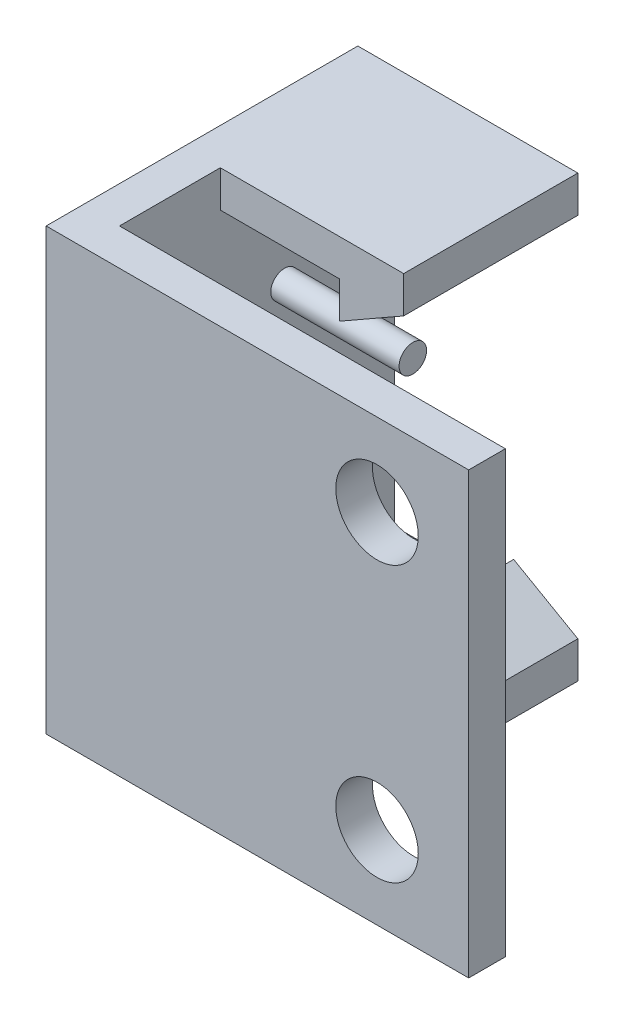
ISO-10303-21;
HEADER;
FILE_DESCRIPTION(('STEP AP214'),'2;1');
FILE_NAME('part.step','',(''),(''),'','','');
FILE_SCHEMA(('AUTOMOTIVE_DESIGN { 1 0 10303 214 1 1 1 1 }'));
ENDSEC;
DATA;
#1=APPLICATION_CONTEXT('core data for automotive mechanical design processes');
#2=APPLICATION_PROTOCOL_DEFINITION('international standard','automotive_design',2000,#1);
#3=PRODUCT_CONTEXT('',#1,'mechanical');
#4=PRODUCT('Part','Part','',(#3));
#5=PRODUCT_RELATED_PRODUCT_CATEGORY('part','',(#4));
#6=PRODUCT_DEFINITION_FORMATION('','',#4);
#7=PRODUCT_DEFINITION_CONTEXT('part definition',#1,'design');
#8=PRODUCT_DEFINITION('design','',#6,#7);
#9=PRODUCT_DEFINITION_SHAPE('','',#8);
#10=(LENGTH_UNIT() NAMED_UNIT(*) SI_UNIT(.MILLI.,.METRE.));
#11=(NAMED_UNIT(*) PLANE_ANGLE_UNIT() SI_UNIT($,.RADIAN.));
#12=(NAMED_UNIT(*) SI_UNIT($,.STERADIAN.) SOLID_ANGLE_UNIT());
#13=UNCERTAINTY_MEASURE_WITH_UNIT(LENGTH_MEASURE(1.E-05),#10,'distance_accuracy_value','');
#14=(GEOMETRIC_REPRESENTATION_CONTEXT(3) GLOBAL_UNCERTAINTY_ASSIGNED_CONTEXT((#13)) GLOBAL_UNIT_ASSIGNED_CONTEXT((#10,
#11,#12)) REPRESENTATION_CONTEXT('',''));
#15=CARTESIAN_POINT('',(0.,0.,0.));
#16=DIRECTION('',(0.,0.,1.));
#17=DIRECTION('',(1.,0.,0.));
#18=AXIS2_PLACEMENT_3D('',#15,#16,#17);
#19=CARTESIAN_POINT('',(2.,0.,0.));
#20=DIRECTION('',(-1.,0.,0.));
#21=DIRECTION('',(0.,0.,1.));
#22=AXIS2_PLACEMENT_3D('',#19,#20,#21);
#23=PLANE('',#22);
#24=CARTESIAN_POINT('',(2.,16.75,-9.));
#25=DIRECTION('',(-1.,0.,0.));
#26=DIRECTION('',(0.,0.,1.));
#27=AXIS2_PLACEMENT_3D('',#24,#25,#26);
#28=CIRCLE('',#27,0.75);
#29=CARTESIAN_POINT('',(2.,16.75,-8.25));
#30=VERTEX_POINT('',#29);
#31=EDGE_CURVE('E184',#30,#30,#28,.F.);
#32=ORIENTED_EDGE('',*,*,#31,.F.);
#33=EDGE_LOOP('',(#32));
#34=FACE_BOUND('',#33,.T.);
#35=DIRECTION('',(0.,0.,-1.));
#36=VECTOR('',#35,1.);
#37=CARTESIAN_POINT('',(2.,22.,0.));
#38=LINE('',#37,#36);
#39=CARTESIAN_POINT('',(2.,22.,-5.5));
#40=VERTEX_POINT('',#39);
#41=CARTESIAN_POINT('',(2.,22.,-15.));
#42=VERTEX_POINT('',#41);
#43=EDGE_CURVE('E37',#40,#42,#38,.T.);
#44=ORIENTED_EDGE('',*,*,#43,.F.);
#45=DIRECTION('',(0.,1.,0.));
#46=VECTOR('',#45,1.);
#47=CARTESIAN_POINT('',(2.,-3.,-5.5));
#48=LINE('',#47,#46);
#49=CARTESIAN_POINT('',(2.,24.,-5.5));
#50=VERTEX_POINT('',#49);
#51=EDGE_CURVE('E570',#40,#50,#48,.T.);
#52=ORIENTED_EDGE('',*,*,#51,.T.);
#53=DIRECTION('',(0.,0.,1.));
#54=VECTOR('',#53,1.);
#55=CARTESIAN_POINT('',(2.,24.,0.));
#56=LINE('',#55,#54);
#57=CARTESIAN_POINT('',(2.,24.,0.));
#58=VERTEX_POINT('',#57);
#59=EDGE_CURVE('E160',#50,#58,#56,.T.);
#60=ORIENTED_EDGE('',*,*,#59,.T.);
#61=DIRECTION('',(0.,-1.,0.));
#62=VECTOR('',#61,1.);
#63=CARTESIAN_POINT('',(2.,0.,0.));
#64=LINE('',#63,#62);
#65=CARTESIAN_POINT('',(2.,0.,0.));
#66=VERTEX_POINT('',#65);
#67=EDGE_CURVE('E203',#58,#66,#64,.T.);
#68=ORIENTED_EDGE('',*,*,#67,.T.);
#69=DIRECTION('',(0.,0.,1.));
#70=VECTOR('',#69,1.);
#71=CARTESIAN_POINT('',(2.,0.,0.));
#72=LINE('',#71,#70);
#73=CARTESIAN_POINT('',(2.,0.,-5.5));
#74=VERTEX_POINT('',#73);
#75=EDGE_CURVE('E313',#74,#66,#72,.T.);
#76=ORIENTED_EDGE('',*,*,#75,.F.);
#77=CARTESIAN_POINT('',(2.,2.,-5.5));
#78=VERTEX_POINT('',#77);
#79=EDGE_CURVE('E611',#74,#78,#48,.T.);
#80=ORIENTED_EDGE('',*,*,#79,.T.);
#81=DIRECTION('',(0.,0.,1.));
#82=VECTOR('',#81,1.);
#83=CARTESIAN_POINT('',(2.,2.,0.));
#84=LINE('',#83,#82);
#85=CARTESIAN_POINT('',(2.,2.,-15.));
#86=VERTEX_POINT('',#85);
#87=EDGE_CURVE('E188',#86,#78,#84,.T.);
#88=ORIENTED_EDGE('',*,*,#87,.F.);
#89=DIRECTION('',(0.,1.,0.));
#90=VECTOR('',#89,1.);
#91=CARTESIAN_POINT('',(2.,0.,-15.));
#92=LINE('',#91,#90);
#93=EDGE_CURVE('E199',#86,#42,#92,.T.);
#94=ORIENTED_EDGE('',*,*,#93,.T.);
#95=EDGE_LOOP('',(#44,#52,#60,#68,#76,#80,#88,#94));
#96=FACE_BOUND('',#95,.T.);
#97=CARTESIAN_POINT('',(2.,7.25,-9.));
#98=DIRECTION('',(-1.,0.,0.));
#99=DIRECTION('',(0.,0.,1.));
#100=AXIS2_PLACEMENT_3D('',#97,#98,#99);
#101=CIRCLE('',#100,0.75);
#102=CARTESIAN_POINT('',(2.,7.25,-8.25));
#103=VERTEX_POINT('',#102);
#104=EDGE_CURVE('E43',#103,#103,#101,.F.);
#105=ORIENTED_EDGE('',*,*,#104,.F.);
#106=EDGE_LOOP('',(#105));
#107=FACE_BOUND('',#106,.T.);
#108=ADVANCED_FACE('F33',(#34,#96,#107),#23,.F.);
#109=CARTESIAN_POINT('',(2.,0.,0.));
#110=DIRECTION('',(0.,1.,0.));
#111=DIRECTION('',(0.,0.,1.));
#112=AXIS2_PLACEMENT_3D('',#109,#110,#111);
#113=PLANE('',#112);
#114=ORIENTED_EDGE('',*,*,#75,.T.);
#115=DIRECTION('',(1.,0.,0.));
#116=VECTOR('',#115,1.);
#117=CARTESIAN_POINT('',(0.,0.,0.));
#118=LINE('',#117,#116);
#119=CARTESIAN_POINT('',(23.0458690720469,0.,0.));
#120=VERTEX_POINT('',#119);
#121=EDGE_CURVE('E264',#66,#120,#118,.T.);
#122=ORIENTED_EDGE('',*,*,#121,.T.);
#123=DIRECTION('',(0.,0.,-1.));
#124=VECTOR('',#123,1.);
#125=CARTESIAN_POINT('',(23.0458690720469,0.,2.));
#126=LINE('',#125,#124);
#127=CARTESIAN_POINT('',(23.0458690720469,0.,2.));
#128=VERTEX_POINT('',#127);
#129=EDGE_CURVE('E263',#128,#120,#126,.T.);
#130=ORIENTED_EDGE('',*,*,#129,.F.);
#131=DIRECTION('',(1.,0.,0.));
#132=VECTOR('',#131,1.);
#133=CARTESIAN_POINT('',(0.,0.,2.));
#134=LINE('',#133,#132);
#135=CARTESIAN_POINT('',(0.,0.,2.));
#136=VERTEX_POINT('',#135);
#137=EDGE_CURVE('E296',#136,#128,#134,.T.);
#138=ORIENTED_EDGE('',*,*,#137,.F.);
#139=DIRECTION('',(0.,0.,-1.));
#140=VECTOR('',#139,1.);
#141=CARTESIAN_POINT('',(0.,0.,0.));
#142=LINE('',#141,#140);
#143=CARTESIAN_POINT('',(0.,0.,-15.));
#144=VERTEX_POINT('',#143);
#145=EDGE_CURVE('E59',#136,#144,#142,.T.);
#146=ORIENTED_EDGE('',*,*,#145,.T.);
#147=DIRECTION('',(-1.,0.,0.));
#148=VECTOR('',#147,1.);
#149=CARTESIAN_POINT('',(2.,0.,-15.));
#150=LINE('',#149,#148);
#151=CARTESIAN_POINT('',(12.,0.,-15.));
#152=VERTEX_POINT('',#151);
#153=EDGE_CURVE('E193',#152,#144,#150,.T.);
#154=ORIENTED_EDGE('',*,*,#153,.F.);
#155=DIRECTION('',(0.,0.,-1.));
#156=VECTOR('',#155,1.);
#157=CARTESIAN_POINT('',(12.,0.,0.));
#158=LINE('',#157,#156);
#159=CARTESIAN_POINT('',(12.,0.,-5.5));
#160=VERTEX_POINT('',#159);
#161=EDGE_CURVE('E186',#160,#152,#158,.T.);
#162=ORIENTED_EDGE('',*,*,#161,.F.);
#163=DIRECTION('',(-1.,0.,0.));
#164=VECTOR('',#163,1.);
#165=CARTESIAN_POINT('',(2.,0.,-5.5));
#166=LINE('',#165,#164);
#167=EDGE_CURVE('E568',#160,#74,#166,.T.);
#168=ORIENTED_EDGE('',*,*,#167,.T.);
#169=EDGE_LOOP('',(#114,#122,#130,#138,#146,#154,#162,#168));
#170=FACE_BOUND('',#169,.T.);
#171=ADVANCED_FACE('F35',(#170),#113,.F.);
#172=CARTESIAN_POINT('',(2.,0.,-15.));
#173=DIRECTION('',(0.,0.,1.));
#174=DIRECTION('',(0.,-1.,0.));
#175=AXIS2_PLACEMENT_3D('',#172,#173,#174);
#176=PLANE('',#175);
#177=DIRECTION('',(0.,1.,0.));
#178=VECTOR('',#177,1.);
#179=CARTESIAN_POINT('',(0.,0.,-15.));
#180=LINE('',#179,#178);
#181=CARTESIAN_POINT('',(0.,24.,-15.));
#182=VERTEX_POINT('',#181);
#183=EDGE_CURVE('E51',#144,#182,#180,.T.);
#184=ORIENTED_EDGE('',*,*,#183,.T.);
#185=DIRECTION('',(-1.,0.,0.));
#186=VECTOR('',#185,1.);
#187=CARTESIAN_POINT('',(2.,24.,-15.));
#188=LINE('',#187,#186);
#189=CARTESIAN_POINT('',(12.,24.,-15.));
#190=VERTEX_POINT('',#189);
#191=EDGE_CURVE('E196',#190,#182,#188,.T.);
#192=ORIENTED_EDGE('',*,*,#191,.F.);
#193=DIRECTION('',(0.,1.,0.));
#194=VECTOR('',#193,1.);
#195=CARTESIAN_POINT('',(12.,24.,-15.));
#196=LINE('',#195,#194);
#197=CARTESIAN_POINT('',(12.,22.,-15.));
#198=VERTEX_POINT('',#197);
#199=EDGE_CURVE('E171',#198,#190,#196,.T.);
#200=ORIENTED_EDGE('',*,*,#199,.F.);
#201=DIRECTION('',(-0.868243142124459,-0.496138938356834,0.));
#202=VECTOR('',#201,1.);
#203=CARTESIAN_POINT('',(12.,22.,-15.));
#204=LINE('',#203,#202);
#205=CARTESIAN_POINT('',(8.5,20.,-15.));
#206=VERTEX_POINT('',#205);
#207=EDGE_CURVE('E252',#198,#206,#204,.T.);
#208=ORIENTED_EDGE('',*,*,#207,.T.);
#209=DIRECTION('',(0.,1.,0.));
#210=VECTOR('',#209,1.);
#211=CARTESIAN_POINT('',(8.5,20.,-15.));
#212=LINE('',#211,#210);
#213=CARTESIAN_POINT('',(8.5,22.,-15.));
#214=VERTEX_POINT('',#213);
#215=EDGE_CURVE('E230',#206,#214,#212,.T.);
#216=ORIENTED_EDGE('',*,*,#215,.T.);
#217=DIRECTION('',(-1.,0.,0.));
#218=VECTOR('',#217,1.);
#219=CARTESIAN_POINT('',(12.,22.,-15.));
#220=LINE('',#219,#218);
#221=EDGE_CURVE('E172',#214,#42,#220,.T.);
#222=ORIENTED_EDGE('',*,*,#221,.T.);
#223=ORIENTED_EDGE('',*,*,#93,.F.);
#224=DIRECTION('',(-1.,0.,0.));
#225=VECTOR('',#224,1.);
#226=CARTESIAN_POINT('',(12.,2.,-15.));
#227=LINE('',#226,#225);
#228=CARTESIAN_POINT('',(8.5,2.,-15.));
#229=VERTEX_POINT('',#228);
#230=EDGE_CURVE('E225',#229,#86,#227,.T.);
#231=ORIENTED_EDGE('',*,*,#230,.F.);
#232=DIRECTION('',(0.,1.,0.));
#233=VECTOR('',#232,1.);
#234=CARTESIAN_POINT('',(8.5,4.,-15.));
#235=LINE('',#234,#233);
#236=CARTESIAN_POINT('',(8.5,4.,-15.));
#237=VERTEX_POINT('',#236);
#238=EDGE_CURVE('E261',#229,#237,#235,.T.);
#239=ORIENTED_EDGE('',*,*,#238,.T.);
#240=DIRECTION('',(0.868243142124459,-0.496138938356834,0.));
#241=VECTOR('',#240,1.);
#242=CARTESIAN_POINT('',(12.,2.,-15.));
#243=LINE('',#242,#241);
#244=CARTESIAN_POINT('',(12.,2.,-15.));
#245=VERTEX_POINT('',#244);
#246=EDGE_CURVE('E257',#237,#245,#243,.T.);
#247=ORIENTED_EDGE('',*,*,#246,.T.);
#248=DIRECTION('',(0.,1.,0.));
#249=VECTOR('',#248,1.);
#250=CARTESIAN_POINT('',(12.,0.,-15.));
#251=LINE('',#250,#249);
#252=EDGE_CURVE('E187',#152,#245,#251,.T.);
#253=ORIENTED_EDGE('',*,*,#252,.F.);
#254=ORIENTED_EDGE('',*,*,#153,.T.);
#255=EDGE_LOOP('',(#184,#192,#200,#208,#216,#222,#223,#231,#239,#247,#253,#254));
#256=FACE_BOUND('',#255,.T.);
#257=ADVANCED_FACE('F223',(#256),#176,.F.);
#258=CARTESIAN_POINT('',(2.,24.,0.));
#259=DIRECTION('',(0.,-1.,0.));
#260=DIRECTION('',(0.,0.,-1.));
#261=AXIS2_PLACEMENT_3D('',#258,#259,#260);
#262=PLANE('',#261);
#263=DIRECTION('',(-1.,0.,0.));
#264=VECTOR('',#263,1.);
#265=CARTESIAN_POINT('',(0.,24.,0.));
#266=LINE('',#265,#264);
#267=CARTESIAN_POINT('',(23.0458690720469,24.,0.));
#268=VERTEX_POINT('',#267);
#269=EDGE_CURVE('E269',#268,#58,#266,.T.);
#270=ORIENTED_EDGE('',*,*,#269,.T.);
#271=ORIENTED_EDGE('',*,*,#59,.F.);
#272=DIRECTION('',(-1.,0.,0.));
#273=VECTOR('',#272,1.);
#274=CARTESIAN_POINT('',(12.,24.,-5.5));
#275=LINE('',#274,#273);
#276=CARTESIAN_POINT('',(12.,24.,-5.5));
#277=VERTEX_POINT('',#276);
#278=EDGE_CURVE('E152',#277,#50,#275,.T.);
#279=ORIENTED_EDGE('',*,*,#278,.F.);
#280=DIRECTION('',(0.,0.,1.));
#281=VECTOR('',#280,1.);
#282=CARTESIAN_POINT('',(12.,24.,0.));
#283=LINE('',#282,#281);
#284=EDGE_CURVE('E165',#190,#277,#283,.T.);
#285=ORIENTED_EDGE('',*,*,#284,.F.);
#286=ORIENTED_EDGE('',*,*,#191,.T.);
#287=DIRECTION('',(0.,0.,1.));
#288=VECTOR('',#287,1.);
#289=CARTESIAN_POINT('',(0.,24.,0.));
#290=LINE('',#289,#288);
#291=CARTESIAN_POINT('',(0.,24.,2.));
#292=VERTEX_POINT('',#291);
#293=EDGE_CURVE('E206',#182,#292,#290,.T.);
#294=ORIENTED_EDGE('',*,*,#293,.T.);
#295=DIRECTION('',(-1.,0.,0.));
#296=VECTOR('',#295,1.);
#297=CARTESIAN_POINT('',(0.,24.,2.));
#298=LINE('',#297,#296);
#299=CARTESIAN_POINT('',(23.0458690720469,24.,2.));
#300=VERTEX_POINT('',#299);
#301=EDGE_CURVE('E275',#300,#292,#298,.T.);
#302=ORIENTED_EDGE('',*,*,#301,.F.);
#303=DIRECTION('',(0.,0.,-1.));
#304=VECTOR('',#303,1.);
#305=CARTESIAN_POINT('',(23.0458690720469,24.,2.));
#306=LINE('',#305,#304);
#307=EDGE_CURVE('E279',#300,#268,#306,.T.);
#308=ORIENTED_EDGE('',*,*,#307,.T.);
#309=EDGE_LOOP('',(#270,#271,#279,#285,#286,#294,#302,#308));
#310=FACE_BOUND('',#309,.T.);
#311=ADVANCED_FACE('F164',(#310),#262,.F.);
#312=CARTESIAN_POINT('',(0.,0.,0.));
#313=DIRECTION('',(-1.,0.,0.));
#314=DIRECTION('',(0.,0.,1.));
#315=AXIS2_PLACEMENT_3D('',#312,#313,#314);
#316=PLANE('',#315);
#317=ORIENTED_EDGE('',*,*,#145,.F.);
#318=DIRECTION('',(0.,-1.,0.));
#319=VECTOR('',#318,1.);
#320=CARTESIAN_POINT('',(0.,24.,2.));
#321=LINE('',#320,#319);
#322=EDGE_CURVE('E294',#292,#136,#321,.T.);
#323=ORIENTED_EDGE('',*,*,#322,.F.);
#324=ORIENTED_EDGE('',*,*,#293,.F.);
#325=ORIENTED_EDGE('',*,*,#183,.F.);
#326=EDGE_LOOP('',(#317,#323,#324,#325));
#327=FACE_BOUND('',#326,.T.);
#328=ADVANCED_FACE('F310',(#327),#316,.T.);
#329=CARTESIAN_POINT('',(12.,22.,0.));
#330=DIRECTION('',(0.,1.,0.));
#331=DIRECTION('',(0.,0.,1.));
#332=AXIS2_PLACEMENT_3D('',#329,#330,#331);
#333=PLANE('',#332);
#334=DIRECTION('',(0.,0.,-1.));
#335=VECTOR('',#334,1.);
#336=CARTESIAN_POINT('',(8.5,22.,-5.));
#337=LINE('',#336,#335);
#338=CARTESIAN_POINT('',(8.5,22.,-5.5));
#339=VERTEX_POINT('',#338);
#340=EDGE_CURVE('E235',#339,#214,#337,.T.);
#341=ORIENTED_EDGE('',*,*,#340,.F.);
#342=DIRECTION('',(-1.,0.,0.));
#343=VECTOR('',#342,1.);
#344=CARTESIAN_POINT('',(12.,22.,-5.5));
#345=LINE('',#344,#343);
#346=EDGE_CURVE('E236',#339,#40,#345,.T.);
#347=ORIENTED_EDGE('',*,*,#346,.T.);
#348=ORIENTED_EDGE('',*,*,#43,.T.);
#349=ORIENTED_EDGE('',*,*,#221,.F.);
#350=EDGE_LOOP('',(#341,#347,#348,#349));
#351=FACE_BOUND('',#350,.T.);
#352=ADVANCED_FACE('F233',(#351),#333,.F.);
#353=CARTESIAN_POINT('',(12.,0.,0.));
#354=DIRECTION('',(1.,0.,0.));
#355=DIRECTION('',(0.,0.,-1.));
#356=AXIS2_PLACEMENT_3D('',#353,#354,#355);
#357=PLANE('',#356);
#358=DIRECTION('',(0.,1.,0.));
#359=VECTOR('',#358,1.);
#360=CARTESIAN_POINT('',(12.,-3.,-5.5));
#361=LINE('',#360,#359);
#362=CARTESIAN_POINT('',(12.,22.,-5.5));
#363=VERTEX_POINT('',#362);
#364=EDGE_CURVE('E149',#363,#277,#361,.T.);
#365=ORIENTED_EDGE('',*,*,#364,.F.);
#366=DIRECTION('',(0.,0.,-1.));
#367=VECTOR('',#366,1.);
#368=CARTESIAN_POINT('',(12.,22.,-5.));
#369=LINE('',#368,#367);
#370=EDGE_CURVE('E246',#363,#198,#369,.T.);
#371=ORIENTED_EDGE('',*,*,#370,.T.);
#372=ORIENTED_EDGE('',*,*,#199,.T.);
#373=ORIENTED_EDGE('',*,*,#284,.T.);
#374=EDGE_LOOP('',(#365,#371,#372,#373));
#375=FACE_BOUND('',#374,.T.);
#376=ADVANCED_FACE('F169',(#375),#357,.T.);
#377=CARTESIAN_POINT('',(12.,2.,0.));
#378=DIRECTION('',(0.,-1.,0.));
#379=DIRECTION('',(0.,0.,-1.));
#380=AXIS2_PLACEMENT_3D('',#377,#378,#379);
#381=PLANE('',#380);
#382=ORIENTED_EDGE('',*,*,#87,.T.);
#383=DIRECTION('',(1.,0.,0.));
#384=VECTOR('',#383,1.);
#385=CARTESIAN_POINT('',(12.,2.,-5.5));
#386=LINE('',#385,#384);
#387=CARTESIAN_POINT('',(8.5,2.,-5.5));
#388=VERTEX_POINT('',#387);
#389=EDGE_CURVE('E573',#78,#388,#386,.T.);
#390=ORIENTED_EDGE('',*,*,#389,.T.);
#391=DIRECTION('',(0.,0.,-1.));
#392=VECTOR('',#391,1.);
#393=CARTESIAN_POINT('',(8.5,2.,-5.));
#394=LINE('',#393,#392);
#395=EDGE_CURVE('E255',#388,#229,#394,.T.);
#396=ORIENTED_EDGE('',*,*,#395,.T.);
#397=ORIENTED_EDGE('',*,*,#230,.T.);
#398=EDGE_LOOP('',(#382,#390,#396,#397));
#399=FACE_BOUND('',#398,.T.);
#400=ADVANCED_FACE('F349',(#399),#381,.F.);
#401=CARTESIAN_POINT('',(12.,0.,0.));
#402=DIRECTION('',(-1.,0.,0.));
#403=DIRECTION('',(0.,0.,1.));
#404=AXIS2_PLACEMENT_3D('',#401,#402,#403);
#405=PLANE('',#404);
#406=DIRECTION('',(0.,0.,1.));
#407=VECTOR('',#406,1.);
#408=CARTESIAN_POINT('',(12.,2.,0.));
#409=LINE('',#408,#407);
#410=CARTESIAN_POINT('',(12.,2.,-5.5));
#411=VERTEX_POINT('',#410);
#412=EDGE_CURVE('E237',#245,#411,#409,.T.);
#413=ORIENTED_EDGE('',*,*,#412,.T.);
#414=EDGE_CURVE('E159',#160,#411,#361,.T.);
#415=ORIENTED_EDGE('',*,*,#414,.F.);
#416=ORIENTED_EDGE('',*,*,#161,.T.);
#417=ORIENTED_EDGE('',*,*,#252,.T.);
#418=EDGE_LOOP('',(#413,#415,#416,#417));
#419=FACE_BOUND('',#418,.T.);
#420=ADVANCED_FACE('F355',(#419),#405,.F.);
#421=CARTESIAN_POINT('',(8.5,20.,-5.));
#422=DIRECTION('',(-1.,0.,0.));
#423=DIRECTION('',(0.,0.,1.));
#424=AXIS2_PLACEMENT_3D('',#421,#422,#423);
#425=PLANE('',#424);
#426=DIRECTION('',(0.,-1.,0.));
#427=VECTOR('',#426,1.);
#428=CARTESIAN_POINT('',(8.5,20.,-5.5));
#429=LINE('',#428,#427);
#430=CARTESIAN_POINT('',(8.5,20.,-5.5));
#431=VERTEX_POINT('',#430);
#432=EDGE_CURVE('E579',#339,#431,#429,.T.);
#433=ORIENTED_EDGE('',*,*,#432,.F.);
#434=ORIENTED_EDGE('',*,*,#340,.T.);
#435=ORIENTED_EDGE('',*,*,#215,.F.);
#436=DIRECTION('',(0.,0.,-1.));
#437=VECTOR('',#436,1.);
#438=CARTESIAN_POINT('',(8.5,20.,-5.));
#439=LINE('',#438,#437);
#440=EDGE_CURVE('E248',#431,#206,#439,.T.);
#441=ORIENTED_EDGE('',*,*,#440,.F.);
#442=EDGE_LOOP('',(#433,#434,#435,#441));
#443=FACE_BOUND('',#442,.T.);
#444=ADVANCED_FACE('F362',(#443),#425,.T.);
#445=CARTESIAN_POINT('',(12.,22.,-5.));
#446=DIRECTION('',(0.496138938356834,-0.868243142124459,0.));
#447=DIRECTION('',(0.868243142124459,0.496138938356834,0.));
#448=AXIS2_PLACEMENT_3D('',#445,#446,#447);
#449=PLANE('',#448);
#450=DIRECTION('',(0.868243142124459,0.496138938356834,0.));
#451=VECTOR('',#450,1.);
#452=CARTESIAN_POINT('',(12.,22.,-5.5));
#453=LINE('',#452,#451);
#454=EDGE_CURVE('E155',#431,#363,#453,.T.);
#455=ORIENTED_EDGE('',*,*,#454,.F.);
#456=ORIENTED_EDGE('',*,*,#440,.T.);
#457=ORIENTED_EDGE('',*,*,#207,.F.);
#458=ORIENTED_EDGE('',*,*,#370,.F.);
#459=EDGE_LOOP('',(#455,#456,#457,#458));
#460=FACE_BOUND('',#459,.T.);
#461=ADVANCED_FACE('F370',(#460),#449,.T.);
#462=CARTESIAN_POINT('',(12.,2.,-5.));
#463=DIRECTION('',(0.496138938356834,0.868243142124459,0.));
#464=DIRECTION('',(-0.868243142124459,0.496138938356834,0.));
#465=AXIS2_PLACEMENT_3D('',#462,#463,#464);
#466=PLANE('',#465);
#467=DIRECTION('',(-0.868243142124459,0.496138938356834,0.));
#468=VECTOR('',#467,1.);
#469=CARTESIAN_POINT('',(12.,2.,-5.5));
#470=LINE('',#469,#468);
#471=CARTESIAN_POINT('',(8.5,4.,-5.5));
#472=VERTEX_POINT('',#471);
#473=EDGE_CURVE('E565',#411,#472,#470,.T.);
#474=ORIENTED_EDGE('',*,*,#473,.F.);
#475=ORIENTED_EDGE('',*,*,#412,.F.);
#476=ORIENTED_EDGE('',*,*,#246,.F.);
#477=DIRECTION('',(0.,0.,-1.));
#478=VECTOR('',#477,1.);
#479=CARTESIAN_POINT('',(8.5,4.,-5.));
#480=LINE('',#479,#478);
#481=EDGE_CURVE('E254',#472,#237,#480,.T.);
#482=ORIENTED_EDGE('',*,*,#481,.F.);
#483=EDGE_LOOP('',(#474,#475,#476,#482));
#484=FACE_BOUND('',#483,.T.);
#485=ADVANCED_FACE('F378',(#484),#466,.T.);
#486=CARTESIAN_POINT('',(8.5,4.,-5.));
#487=DIRECTION('',(-1.,0.,0.));
#488=DIRECTION('',(0.,0.,1.));
#489=AXIS2_PLACEMENT_3D('',#486,#487,#488);
#490=PLANE('',#489);
#491=DIRECTION('',(0.,-1.,0.));
#492=VECTOR('',#491,1.);
#493=CARTESIAN_POINT('',(8.5,4.,-5.5));
#494=LINE('',#493,#492);
#495=EDGE_CURVE('E11',#472,#388,#494,.T.);
#496=ORIENTED_EDGE('',*,*,#495,.F.);
#497=ORIENTED_EDGE('',*,*,#481,.T.);
#498=ORIENTED_EDGE('',*,*,#238,.F.);
#499=ORIENTED_EDGE('',*,*,#395,.F.);
#500=EDGE_LOOP('',(#496,#497,#498,#499));
#501=FACE_BOUND('',#500,.T.);
#502=ADVANCED_FACE('F386',(#501),#490,.T.);
#503=CARTESIAN_POINT('',(0.,0.,2.));
#504=DIRECTION('',(0.,0.,1.));
#505=DIRECTION('',(1.,0.,0.));
#506=AXIS2_PLACEMENT_3D('',#503,#504,#505);
#507=PLANE('',#506);
#508=CARTESIAN_POINT('',(18.0458690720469,19.5,2.));
#509=DIRECTION('',(0.,0.,1.));
#510=DIRECTION('',(1.,0.,0.));
#511=AXIS2_PLACEMENT_3D('',#508,#509,#510);
#512=CIRCLE('',#511,2.25);
#513=CARTESIAN_POINT('',(20.2958690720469,19.5,2.));
#514=VERTEX_POINT('',#513);
#515=EDGE_CURVE('E268',#514,#514,#512,.T.);
#516=ORIENTED_EDGE('',*,*,#515,.F.);
#517=EDGE_LOOP('',(#516));
#518=FACE_BOUND('',#517,.T.);
#519=ORIENTED_EDGE('',*,*,#322,.T.);
#520=ORIENTED_EDGE('',*,*,#137,.T.);
#521=DIRECTION('',(0.,1.,0.));
#522=VECTOR('',#521,1.);
#523=CARTESIAN_POINT('',(23.0458690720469,24.,2.));
#524=LINE('',#523,#522);
#525=EDGE_CURVE('E288',#128,#300,#524,.T.);
#526=ORIENTED_EDGE('',*,*,#525,.T.);
#527=ORIENTED_EDGE('',*,*,#301,.T.);
#528=EDGE_LOOP('',(#519,#520,#526,#527));
#529=FACE_BOUND('',#528,.T.);
#530=CARTESIAN_POINT('',(18.0458690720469,4.5,2.));
#531=DIRECTION('',(0.,0.,1.));
#532=DIRECTION('',(1.,0.,0.));
#533=AXIS2_PLACEMENT_3D('',#530,#531,#532);
#534=CIRCLE('',#533,2.25);
#535=CARTESIAN_POINT('',(20.2958690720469,4.5,2.));
#536=VERTEX_POINT('',#535);
#537=EDGE_CURVE('E593',#536,#536,#534,.T.);
#538=ORIENTED_EDGE('',*,*,#537,.F.);
#539=EDGE_LOOP('',(#538));
#540=FACE_BOUND('',#539,.T.);
#541=ADVANCED_FACE('F306',(#518,#529,#540),#507,.T.);
#542=CARTESIAN_POINT('',(0.,0.,0.));
#543=DIRECTION('',(0.,0.,1.));
#544=DIRECTION('',(1.,0.,0.));
#545=AXIS2_PLACEMENT_3D('',#542,#543,#544);
#546=PLANE('',#545);
#547=ORIENTED_EDGE('',*,*,#67,.F.);
#548=ORIENTED_EDGE('',*,*,#269,.F.);
#549=DIRECTION('',(0.,1.,0.));
#550=VECTOR('',#549,1.);
#551=CARTESIAN_POINT('',(23.0458690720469,24.,0.));
#552=LINE('',#551,#550);
#553=EDGE_CURVE('E267',#120,#268,#552,.T.);
#554=ORIENTED_EDGE('',*,*,#553,.F.);
#555=ORIENTED_EDGE('',*,*,#121,.F.);
#556=EDGE_LOOP('',(#547,#548,#554,#555));
#557=FACE_BOUND('',#556,.T.);
#558=CARTESIAN_POINT('',(18.0458690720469,19.5,0.));
#559=DIRECTION('',(0.,0.,1.));
#560=DIRECTION('',(1.,0.,0.));
#561=AXIS2_PLACEMENT_3D('',#558,#559,#560);
#562=CIRCLE('',#561,2.25);
#563=CARTESIAN_POINT('',(20.2958690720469,19.5,0.));
#564=VERTEX_POINT('',#563);
#565=EDGE_CURVE('E303',#564,#564,#562,.T.);
#566=ORIENTED_EDGE('',*,*,#565,.T.);
#567=EDGE_LOOP('',(#566));
#568=FACE_BOUND('',#567,.T.);
#569=CARTESIAN_POINT('',(18.0458690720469,4.5,0.));
#570=DIRECTION('',(0.,0.,1.));
#571=DIRECTION('',(1.,0.,0.));
#572=AXIS2_PLACEMENT_3D('',#569,#570,#571);
#573=CIRCLE('',#572,2.25);
#574=CARTESIAN_POINT('',(20.2958690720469,4.5,0.));
#575=VERTEX_POINT('',#574);
#576=EDGE_CURVE('E592',#575,#575,#573,.T.);
#577=ORIENTED_EDGE('',*,*,#576,.T.);
#578=EDGE_LOOP('',(#577));
#579=FACE_BOUND('',#578,.T.);
#580=ADVANCED_FACE('F292',(#557,#568,#579),#546,.F.);
#581=CARTESIAN_POINT('',(23.0458690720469,24.,2.));
#582=DIRECTION('',(-1.,0.,0.));
#583=DIRECTION('',(0.,0.,1.));
#584=AXIS2_PLACEMENT_3D('',#581,#582,#583);
#585=PLANE('',#584);
#586=ORIENTED_EDGE('',*,*,#553,.T.);
#587=ORIENTED_EDGE('',*,*,#307,.F.);
#588=ORIENTED_EDGE('',*,*,#525,.F.);
#589=ORIENTED_EDGE('',*,*,#129,.T.);
#590=EDGE_LOOP('',(#586,#587,#588,#589));
#591=FACE_BOUND('',#590,.T.);
#592=ADVANCED_FACE('F286',(#591),#585,.F.);
#593=CARTESIAN_POINT('',(18.0458690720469,19.5,2.));
#594=DIRECTION('',(0.,0.,-1.));
#595=DIRECTION('',(-1.,0.,0.));
#596=AXIS2_PLACEMENT_3D('',#593,#594,#595);
#597=CYLINDRICAL_SURFACE('',#596,2.25);
#598=ORIENTED_EDGE('',*,*,#515,.T.);
#599=EDGE_LOOP('',(#598));
#600=FACE_BOUND('',#599,.T.);
#601=ORIENTED_EDGE('',*,*,#565,.F.);
#602=EDGE_LOOP('',(#601));
#603=FACE_BOUND('',#602,.T.);
#604=ADVANCED_FACE('F414',(#600,#603),#597,.F.);
#605=CARTESIAN_POINT('',(18.0458690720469,4.5,2.));
#606=DIRECTION('',(0.,0.,-1.));
#607=DIRECTION('',(-1.,0.,0.));
#608=AXIS2_PLACEMENT_3D('',#605,#606,#607);
#609=CYLINDRICAL_SURFACE('',#608,2.25);
#610=ORIENTED_EDGE('',*,*,#537,.T.);
#611=EDGE_LOOP('',(#610));
#612=FACE_BOUND('',#611,.T.);
#613=ORIENTED_EDGE('',*,*,#576,.F.);
#614=EDGE_LOOP('',(#613));
#615=FACE_BOUND('',#614,.T.);
#616=ADVANCED_FACE('F421',(#612,#615),#609,.F.);
#617=CARTESIAN_POINT('',(9.,16.75,-9.));
#618=DIRECTION('',(-1.,0.,0.));
#619=DIRECTION('',(0.,0.,1.));
#620=AXIS2_PLACEMENT_3D('',#617,#618,#619);
#621=CYLINDRICAL_SURFACE('',#620,0.75);
#622=CARTESIAN_POINT('',(9.,16.75,-9.));
#623=DIRECTION('',(1.,0.,0.));
#624=DIRECTION('',(0.,0.,-1.));
#625=AXIS2_PLACEMENT_3D('',#622,#623,#624);
#626=CIRCLE('',#625,0.75);
#627=CARTESIAN_POINT('',(9.,16.75,-9.75));
#628=VERTEX_POINT('',#627);
#629=EDGE_CURVE('E589',#628,#628,#626,.T.);
#630=ORIENTED_EDGE('',*,*,#629,.F.);
#631=EDGE_LOOP('',(#630));
#632=FACE_BOUND('',#631,.T.);
#633=ORIENTED_EDGE('',*,*,#31,.T.);
#634=EDGE_LOOP('',(#633));
#635=FACE_BOUND('',#634,.T.);
#636=ADVANCED_FACE('F429',(#632,#635),#621,.T.);
#637=CARTESIAN_POINT('',(9.,16.75,-9.));
#638=DIRECTION('',(1.,0.,0.));
#639=DIRECTION('',(0.,0.,-1.));
#640=AXIS2_PLACEMENT_3D('',#637,#638,#639);
#641=PLANE('',#640);
#642=ORIENTED_EDGE('',*,*,#629,.T.);
#643=EDGE_LOOP('',(#642));
#644=FACE_BOUND('',#643,.T.);
#645=ADVANCED_FACE('F437',(#644),#641,.T.);
#646=CARTESIAN_POINT('',(9.,7.25,-9.));
#647=DIRECTION('',(-1.,0.,0.));
#648=DIRECTION('',(0.,0.,1.));
#649=AXIS2_PLACEMENT_3D('',#646,#647,#648);
#650=CYLINDRICAL_SURFACE('',#649,0.75);
#651=CARTESIAN_POINT('',(9.,7.25,-9.));
#652=DIRECTION('',(1.,0.,0.));
#653=DIRECTION('',(0.,0.,-1.));
#654=AXIS2_PLACEMENT_3D('',#651,#652,#653);
#655=CIRCLE('',#654,0.75);
#656=CARTESIAN_POINT('',(9.,7.25,-9.75));
#657=VERTEX_POINT('',#656);
#658=EDGE_CURVE('E586',#657,#657,#655,.T.);
#659=ORIENTED_EDGE('',*,*,#658,.F.);
#660=EDGE_LOOP('',(#659));
#661=FACE_BOUND('',#660,.T.);
#662=ORIENTED_EDGE('',*,*,#104,.T.);
#663=EDGE_LOOP('',(#662));
#664=FACE_BOUND('',#663,.T.);
#665=ADVANCED_FACE('F445',(#661,#664),#650,.T.);
#666=CARTESIAN_POINT('',(9.,7.25,-9.));
#667=DIRECTION('',(1.,0.,0.));
#668=DIRECTION('',(0.,0.,-1.));
#669=AXIS2_PLACEMENT_3D('',#666,#667,#668);
#670=PLANE('',#669);
#671=ORIENTED_EDGE('',*,*,#658,.T.);
#672=EDGE_LOOP('',(#671));
#673=FACE_BOUND('',#672,.T.);
#674=ADVANCED_FACE('F453',(#673),#670,.T.);
#675=CARTESIAN_POINT('',(12.,-3.,-5.5));
#676=DIRECTION('',(0.,0.,-1.));
#677=DIRECTION('',(-1.,0.,0.));
#678=AXIS2_PLACEMENT_3D('',#675,#676,#677);
#679=PLANE('',#678);
#680=ORIENTED_EDGE('',*,*,#432,.T.);
#681=ORIENTED_EDGE('',*,*,#454,.T.);
#682=ORIENTED_EDGE('',*,*,#364,.T.);
#683=ORIENTED_EDGE('',*,*,#278,.T.);
#684=ORIENTED_EDGE('',*,*,#51,.F.);
#685=ORIENTED_EDGE('',*,*,#346,.F.);
#686=EDGE_LOOP('',(#680,#681,#682,#683,#684,#685));
#687=FACE_BOUND('',#686,.T.);
#688=ADVANCED_FACE('F151',(#687),#679,.F.);
#689=ORIENTED_EDGE('',*,*,#414,.T.);
#690=ORIENTED_EDGE('',*,*,#473,.T.);
#691=ORIENTED_EDGE('',*,*,#495,.T.);
#692=ORIENTED_EDGE('',*,*,#389,.F.);
#693=ORIENTED_EDGE('',*,*,#79,.F.);
#694=ORIENTED_EDGE('',*,*,#167,.F.);
#695=EDGE_LOOP('',(#689,#690,#691,#692,#693,#694));
#696=FACE_BOUND('',#695,.T.);
#697=ADVANCED_FACE('F467',(#696),#679,.F.);
#698=CLOSED_SHELL('',(#108,#171,#257,#311,#328,#352,#376,#400,#420,#444,#461,#485,#502,#541,
#580,#592,#604,#616,#636,#645,#665,#674,#688,#697));
#699=MANIFOLD_SOLID_BREP('B2',#698);
#700=ADVANCED_BREP_SHAPE_REPRESENTATION('',(#18,#699),#14);
#701=SHAPE_DEFINITION_REPRESENTATION(#9,#700);
ENDSEC;
END-ISO-10303-21;
